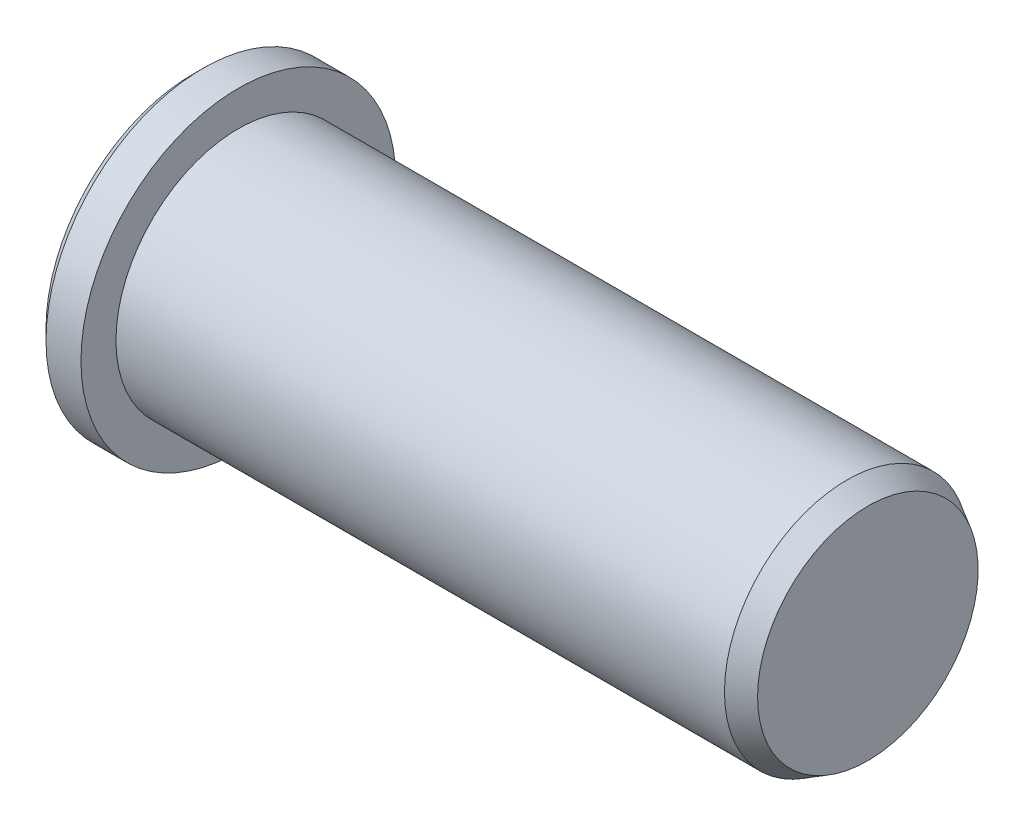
ISO-10303-21;
HEADER;
FILE_DESCRIPTION(('STEP AP214'),'2;1');
FILE_NAME('part.step','',(''),(''),'','','');
FILE_SCHEMA(('AUTOMOTIVE_DESIGN { 1 0 10303 214 1 1 1 1 }'));
ENDSEC;
DATA;
#1=APPLICATION_CONTEXT('core data for automotive mechanical design processes');
#2=APPLICATION_PROTOCOL_DEFINITION('international standard','automotive_design',2000,#1);
#3=PRODUCT_CONTEXT('',#1,'mechanical');
#4=PRODUCT('Part','Part','',(#3));
#5=PRODUCT_RELATED_PRODUCT_CATEGORY('part','',(#4));
#6=PRODUCT_DEFINITION_FORMATION('','',#4);
#7=PRODUCT_DEFINITION_CONTEXT('part definition',#1,'design');
#8=PRODUCT_DEFINITION('design','',#6,#7);
#9=PRODUCT_DEFINITION_SHAPE('','',#8);
#10=(LENGTH_UNIT() NAMED_UNIT(*) SI_UNIT(.MILLI.,.METRE.));
#11=(NAMED_UNIT(*) PLANE_ANGLE_UNIT() SI_UNIT($,.RADIAN.));
#12=(NAMED_UNIT(*) SI_UNIT($,.STERADIAN.) SOLID_ANGLE_UNIT());
#13=UNCERTAINTY_MEASURE_WITH_UNIT(LENGTH_MEASURE(1.E-05),#10,'distance_accuracy_value','');
#14=(GEOMETRIC_REPRESENTATION_CONTEXT(3) GLOBAL_UNCERTAINTY_ASSIGNED_CONTEXT((#13)) GLOBAL_UNIT_ASSIGNED_CONTEXT((#10,
#11,#12)) REPRESENTATION_CONTEXT('',''));
#15=CARTESIAN_POINT('',(0.,0.,0.));
#16=DIRECTION('',(0.,0.,1.));
#17=DIRECTION('',(1.,0.,0.));
#18=AXIS2_PLACEMENT_3D('',#15,#16,#17);
#19=CARTESIAN_POINT('',(0.,0.,0.));
#20=DIRECTION('',(1.,0.,0.));
#21=DIRECTION('',(0.,0.,-1.));
#22=AXIS2_PLACEMENT_3D('',#19,#20,#21);
#23=PLANE('',#22);
#24=CARTESIAN_POINT('',(0.,0.,0.));
#25=DIRECTION('',(-1.,0.,0.));
#26=DIRECTION('',(0.,0.,1.));
#27=AXIS2_PLACEMENT_3D('',#24,#25,#26);
#28=CIRCLE('',#27,42.);
#29=CARTESIAN_POINT('',(0.,0.,42.));
#30=VERTEX_POINT('',#29);
#31=EDGE_CURVE('E10',#30,#30,#28,.T.);
#32=ORIENTED_EDGE('',*,*,#31,.T.);
#33=EDGE_LOOP('',(#32));
#34=FACE_BOUND('',#33,.T.);
#35=ADVANCED_FACE('F31',(#34),#23,.F.);
#36=CARTESIAN_POINT('',(3.,0.,0.));
#37=DIRECTION('',(1.,0.,0.));
#38=DIRECTION('',(0.,0.,-1.));
#39=AXIS2_PLACEMENT_3D('',#36,#37,#38);
#40=CONICAL_SURFACE('',#39,45.,0.785398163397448);
#41=ORIENTED_EDGE('',*,*,#31,.F.);
#42=EDGE_LOOP('',(#41));
#43=FACE_BOUND('',#42,.T.);
#44=CARTESIAN_POINT('',(3.,0.,0.));
#45=DIRECTION('',(-1.,0.,0.));
#46=DIRECTION('',(0.,0.,1.));
#47=AXIS2_PLACEMENT_3D('',#44,#45,#46);
#48=CIRCLE('',#47,45.);
#49=CARTESIAN_POINT('',(3.,0.,45.));
#50=VERTEX_POINT('',#49);
#51=EDGE_CURVE('E37',#50,#50,#48,.T.);
#52=ORIENTED_EDGE('',*,*,#51,.T.);
#53=EDGE_LOOP('',(#52));
#54=FACE_BOUND('',#53,.T.);
#55=ADVANCED_FACE('F69',(#43,#54),#40,.T.);
#56=CARTESIAN_POINT('',(0.,0.,0.));
#57=DIRECTION('',(-1.,0.,0.));
#58=DIRECTION('',(0.,0.,1.));
#59=AXIS2_PLACEMENT_3D('',#56,#57,#58);
#60=CYLINDRICAL_SURFACE('',#59,45.);
#61=ORIENTED_EDGE('',*,*,#51,.F.);
#62=EDGE_LOOP('',(#61));
#63=FACE_BOUND('',#62,.T.);
#64=CARTESIAN_POINT('',(13.,0.,0.));
#65=DIRECTION('',(-1.,0.,0.));
#66=DIRECTION('',(0.,0.,1.));
#67=AXIS2_PLACEMENT_3D('',#64,#65,#66);
#68=CIRCLE('',#67,45.);
#69=CARTESIAN_POINT('',(13.,0.,45.));
#70=VERTEX_POINT('',#69);
#71=EDGE_CURVE('E41',#70,#70,#68,.T.);
#72=ORIENTED_EDGE('',*,*,#71,.T.);
#73=EDGE_LOOP('',(#72));
#74=FACE_BOUND('',#73,.T.);
#75=ADVANCED_FACE('F73',(#63,#74),#60,.T.);
#76=CARTESIAN_POINT('',(13.,45.,0.));
#77=DIRECTION('',(-1.,0.,0.));
#78=DIRECTION('',(0.,0.,1.));
#79=AXIS2_PLACEMENT_3D('',#76,#77,#78);
#80=PLANE('',#79);
#81=ORIENTED_EDGE('',*,*,#71,.F.);
#82=EDGE_LOOP('',(#81));
#83=FACE_BOUND('',#82,.T.);
#84=CARTESIAN_POINT('',(13.,0.,0.));
#85=DIRECTION('',(-1.,0.,0.));
#86=DIRECTION('',(0.,0.,1.));
#87=AXIS2_PLACEMENT_3D('',#84,#85,#86);
#88=CIRCLE('',#87,35.);
#89=CARTESIAN_POINT('',(13.,0.,35.));
#90=VERTEX_POINT('',#89);
#91=EDGE_CURVE('E45',#90,#90,#88,.T.);
#92=ORIENTED_EDGE('',*,*,#91,.T.);
#93=EDGE_LOOP('',(#92));
#94=FACE_BOUND('',#93,.T.);
#95=ADVANCED_FACE('F78',(#83,#94),#80,.F.);
#96=CARTESIAN_POINT('',(0.,0.,0.));
#97=DIRECTION('',(-1.,0.,0.));
#98=DIRECTION('',(0.,0.,1.));
#99=AXIS2_PLACEMENT_3D('',#96,#97,#98);
#100=CYLINDRICAL_SURFACE('',#99,35.);
#101=ORIENTED_EDGE('',*,*,#91,.F.);
#102=EDGE_LOOP('',(#101));
#103=FACE_BOUND('',#102,.T.);
#104=CARTESIAN_POINT('',(187.,0.,0.));
#105=DIRECTION('',(-1.,0.,0.));
#106=DIRECTION('',(0.,0.,1.));
#107=AXIS2_PLACEMENT_3D('',#104,#105,#106);
#108=CIRCLE('',#107,35.);
#109=CARTESIAN_POINT('',(187.,0.,35.));
#110=VERTEX_POINT('',#109);
#111=EDGE_CURVE('E50',#110,#110,#108,.T.);
#112=ORIENTED_EDGE('',*,*,#111,.T.);
#113=EDGE_LOOP('',(#112));
#114=FACE_BOUND('',#113,.T.);
#115=ADVANCED_FACE('F65',(#103,#114),#100,.T.);
#116=CARTESIAN_POINT('',(193.,0.,0.));
#117=DIRECTION('',(-1.,0.,0.));
#118=DIRECTION('',(0.,0.,1.));
#119=AXIS2_PLACEMENT_3D('',#116,#117,#118);
#120=CONICAL_SURFACE('',#119,31.5358983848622,0.5235987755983);
#121=ORIENTED_EDGE('',*,*,#111,.F.);
#122=EDGE_LOOP('',(#121));
#123=FACE_BOUND('',#122,.T.);
#124=CARTESIAN_POINT('',(193.,0.,0.));
#125=DIRECTION('',(-1.,0.,0.));
#126=DIRECTION('',(0.,0.,1.));
#127=AXIS2_PLACEMENT_3D('',#124,#125,#126);
#128=CIRCLE('',#127,31.5358983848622);
#129=CARTESIAN_POINT('',(193.,0.,31.5358983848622));
#130=VERTEX_POINT('',#129);
#131=EDGE_CURVE('E53',#130,#130,#128,.T.);
#132=ORIENTED_EDGE('',*,*,#131,.T.);
#133=EDGE_LOOP('',(#132));
#134=FACE_BOUND('',#133,.T.);
#135=ADVANCED_FACE('F57',(#123,#134),#120,.T.);
#136=CARTESIAN_POINT('',(193.,31.5358983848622,0.));
#137=DIRECTION('',(-1.,0.,0.));
#138=DIRECTION('',(0.,0.,1.));
#139=AXIS2_PLACEMENT_3D('',#136,#137,#138);
#140=PLANE('',#139);
#141=ORIENTED_EDGE('',*,*,#131,.F.);
#142=EDGE_LOOP('',(#141));
#143=FACE_BOUND('',#142,.T.);
#144=ADVANCED_FACE('F59',(#143),#140,.F.);
#145=CLOSED_SHELL('',(#35,#55,#75,#95,#115,#135,#144));
#146=MANIFOLD_SOLID_BREP('B2',#145);
#147=ADVANCED_BREP_SHAPE_REPRESENTATION('',(#18,#146),#14);
#148=SHAPE_DEFINITION_REPRESENTATION(#9,#147);
ENDSEC;
END-ISO-10303-21;
